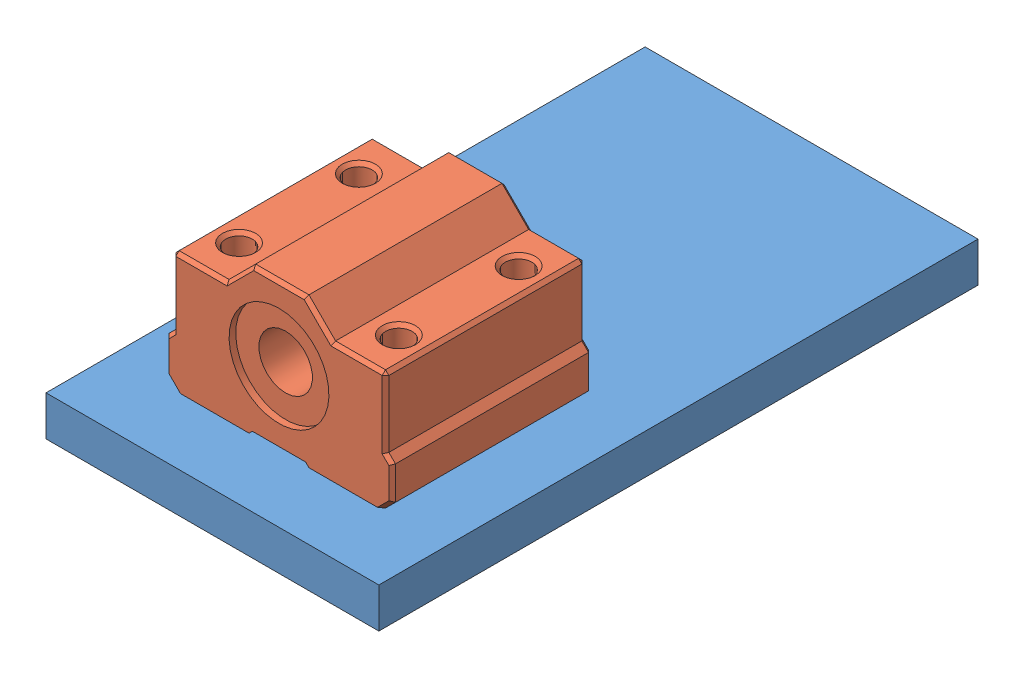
SolidWorks assembly test.SLDASM, configuration Standard (file format 8000). Lengths in mm.
Overall size (50 28 90).
2 component instances, 2 part files, 3 mates.
Components (placement in the parent):
- bt_Laserplatte-1: bt_Laserplatte.SLDPRT [Standard] at (16.0245 -2.7163 90) size (50 6 90)
- bt_SCS8UU_-3: bt_SCS8UU_.SLDPRT [Standard] at (-9.0691 11.9651 50) size (34 22 30)
Mates (geometry in assembly coordinates):
- Abstand16: distance: bt_Laserplatte-1, bt_SCS8UU_-3
- Abstand21: distance: bt_Laserplatte-1, bt_SCS8UU_-3
- Abstand20: distance: bt_Laserplatte-1, bt_SCS8UU_-3
